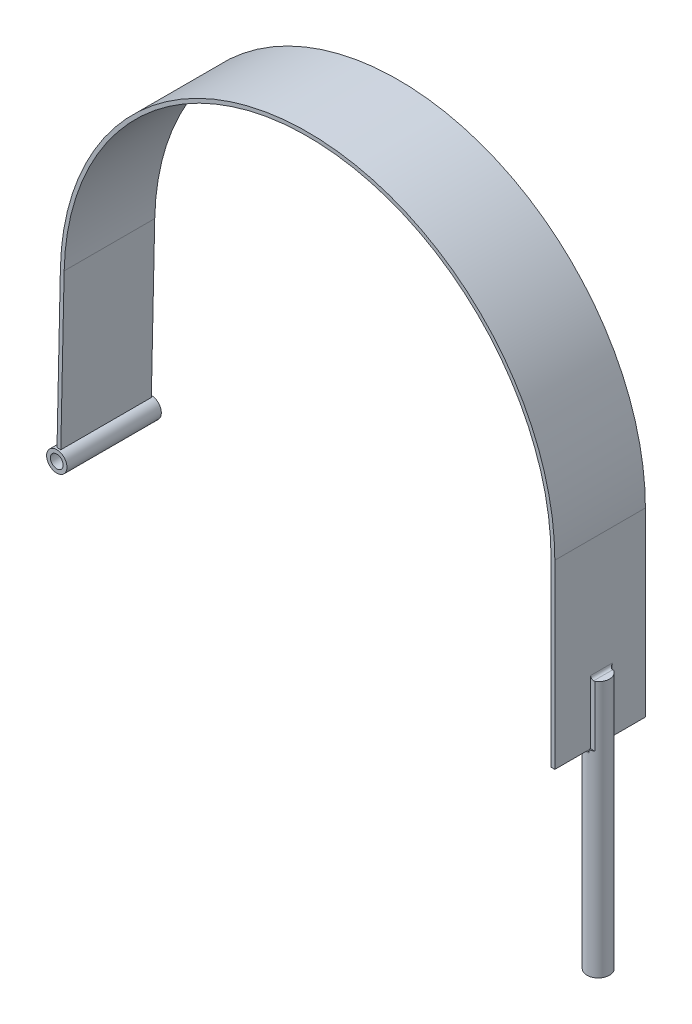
ISO-10303-21;
HEADER;
FILE_DESCRIPTION(('STEP AP214'),'2;1');
FILE_NAME('part.step','',(''),(''),'','','');
FILE_SCHEMA(('AUTOMOTIVE_DESIGN { 1 0 10303 214 1 1 1 1 }'));
ENDSEC;
DATA;
#1=APPLICATION_CONTEXT('core data for automotive mechanical design processes');
#2=APPLICATION_PROTOCOL_DEFINITION('international standard','automotive_design',2000,#1);
#3=PRODUCT_CONTEXT('',#1,'mechanical');
#4=PRODUCT('Part','Part','',(#3));
#5=PRODUCT_RELATED_PRODUCT_CATEGORY('part','',(#4));
#6=PRODUCT_DEFINITION_FORMATION('','',#4);
#7=PRODUCT_DEFINITION_CONTEXT('part definition',#1,'design');
#8=PRODUCT_DEFINITION('design','',#6,#7);
#9=PRODUCT_DEFINITION_SHAPE('','',#8);
#10=(LENGTH_UNIT() NAMED_UNIT(*) SI_UNIT(.MILLI.,.METRE.));
#11=(NAMED_UNIT(*) PLANE_ANGLE_UNIT() SI_UNIT($,.RADIAN.));
#12=(NAMED_UNIT(*) SI_UNIT($,.STERADIAN.) SOLID_ANGLE_UNIT());
#13=UNCERTAINTY_MEASURE_WITH_UNIT(LENGTH_MEASURE(1.E-05),#10,'distance_accuracy_value','');
#14=(GEOMETRIC_REPRESENTATION_CONTEXT(3) GLOBAL_UNCERTAINTY_ASSIGNED_CONTEXT((#13)) GLOBAL_UNIT_ASSIGNED_CONTEXT((#10,
#11,#12)) REPRESENTATION_CONTEXT('',''));
#15=CARTESIAN_POINT('',(0.,0.,0.));
#16=DIRECTION('',(0.,0.,1.));
#17=DIRECTION('',(1.,0.,0.));
#18=AXIS2_PLACEMENT_3D('',#15,#16,#17);
#19=CARTESIAN_POINT('',(-209.417704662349,-135.914745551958,39.6875));
#20=DIRECTION('',(0.,0.,1.));
#21=DIRECTION('',(1.,0.,0.));
#22=AXIS2_PLACEMENT_3D('',#19,#20,#21);
#23=PLANE('',#22);
#24=CARTESIAN_POINT('',(-209.417704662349,-135.914745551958,39.6875));
#25=DIRECTION('',(0.,0.,1.));
#26=DIRECTION('',(1.,0.,0.));
#27=AXIS2_PLACEMENT_3D('',#24,#25,#26);
#28=CIRCLE('',#27,8.57250000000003);
#29=CARTESIAN_POINT('',(-217.990204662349,-135.914745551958,39.6875));
#30=VERTEX_POINT('',#29);
#31=EDGE_CURVE('E11',#30,#30,#28,.T.);
#32=ORIENTED_EDGE('',*,*,#31,.T.);
#33=EDGE_LOOP('',(#32));
#34=FACE_BOUND('',#33,.T.);
#35=CARTESIAN_POINT('',(-209.417704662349,-135.914745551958,39.6875));
#36=DIRECTION('',(0.,0.,1.));
#37=DIRECTION('',(1.,0.,0.));
#38=AXIS2_PLACEMENT_3D('',#35,#36,#37);
#39=CIRCLE('',#38,5.37209999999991);
#40=CARTESIAN_POINT('',(-214.789804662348,-135.914745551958,39.6875));
#41=VERTEX_POINT('',#40);
#42=EDGE_CURVE('E45',#41,#41,#39,.T.);
#43=ORIENTED_EDGE('',*,*,#42,.F.);
#44=EDGE_LOOP('',(#43));
#45=FACE_BOUND('',#44,.T.);
#46=ADVANCED_FACE('F34',(#34,#45),#23,.T.);
#47=CARTESIAN_POINT('',(-209.417704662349,-135.914745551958,-39.6875));
#48=DIRECTION('',(0.,0.,1.));
#49=DIRECTION('',(1.,0.,0.));
#50=AXIS2_PLACEMENT_3D('',#47,#48,#49);
#51=PLANE('',#50);
#52=CARTESIAN_POINT('',(-209.417704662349,-135.914745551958,-39.6875));
#53=DIRECTION('',(0.,0.,1.));
#54=DIRECTION('',(1.,0.,0.));
#55=AXIS2_PLACEMENT_3D('',#52,#53,#54);
#56=CIRCLE('',#55,8.57250000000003);
#57=CARTESIAN_POINT('',(-217.990204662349,-135.914745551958,-39.6875));
#58=VERTEX_POINT('',#57);
#59=EDGE_CURVE('E41',#58,#58,#56,.T.);
#60=ORIENTED_EDGE('',*,*,#59,.F.);
#61=EDGE_LOOP('',(#60));
#62=FACE_BOUND('',#61,.T.);
#63=CARTESIAN_POINT('',(-209.417704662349,-135.914745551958,-39.6875));
#64=DIRECTION('',(0.,0.,1.));
#65=DIRECTION('',(1.,0.,0.));
#66=AXIS2_PLACEMENT_3D('',#63,#64,#65);
#67=CIRCLE('',#66,5.37209999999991);
#68=CARTESIAN_POINT('',(-214.789804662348,-135.914745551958,-39.6875));
#69=VERTEX_POINT('',#68);
#70=EDGE_CURVE('E49',#69,#69,#67,.T.);
#71=ORIENTED_EDGE('',*,*,#70,.T.);
#72=EDGE_LOOP('',(#71));
#73=FACE_BOUND('',#72,.T.);
#74=ADVANCED_FACE('F55',(#62,#73),#51,.F.);
#75=CARTESIAN_POINT('',(-209.417704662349,-135.914745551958,39.6875));
#76=DIRECTION('',(0.,0.,-1.));
#77=DIRECTION('',(-1.,0.,0.));
#78=AXIS2_PLACEMENT_3D('',#75,#76,#77);
#79=CYLINDRICAL_SURFACE('',#78,8.57250000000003);
#80=CARTESIAN_POINT('',(-217.990204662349,-135.914745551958,39.6875));
#81=CARTESIAN_POINT('',(-217.990204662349,-135.914745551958,38.8606770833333));
#82=CARTESIAN_POINT('',(-217.990204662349,-135.914745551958,38.0338541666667));
#83=CARTESIAN_POINT('',(-217.990204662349,-135.914745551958,36.3802083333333));
#84=CARTESIAN_POINT('',(-217.990204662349,-135.914745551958,35.5533854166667));
#85=CARTESIAN_POINT('',(-217.990204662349,-135.914745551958,33.8997395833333));
#86=CARTESIAN_POINT('',(-217.990204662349,-135.914745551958,33.0729166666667));
#87=CARTESIAN_POINT('',(-217.990204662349,-135.914745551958,31.4192708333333));
#88=CARTESIAN_POINT('',(-217.990204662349,-135.914745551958,30.5924479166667));
#89=CARTESIAN_POINT('',(-217.990204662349,-135.914745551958,28.9388020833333));
#90=CARTESIAN_POINT('',(-217.990204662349,-135.914745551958,28.1119791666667));
#91=CARTESIAN_POINT('',(-217.990204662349,-135.914745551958,26.4583333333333));
#92=CARTESIAN_POINT('',(-217.990204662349,-135.914745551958,25.6315104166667));
#93=CARTESIAN_POINT('',(-217.990204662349,-135.914745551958,23.9778645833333));
#94=CARTESIAN_POINT('',(-217.990204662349,-135.914745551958,23.1510416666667));
#95=CARTESIAN_POINT('',(-217.990204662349,-135.914745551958,21.4973958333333));
#96=CARTESIAN_POINT('',(-217.990204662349,-135.914745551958,20.6705729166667));
#97=CARTESIAN_POINT('',(-217.990204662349,-135.914745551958,19.0169270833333));
#98=CARTESIAN_POINT('',(-217.990204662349,-135.914745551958,18.1901041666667));
#99=CARTESIAN_POINT('',(-217.990204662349,-135.914745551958,16.5364583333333));
#100=CARTESIAN_POINT('',(-217.990204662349,-135.914745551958,15.7096354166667));
#101=CARTESIAN_POINT('',(-217.990204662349,-135.914745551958,14.0559895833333));
#102=CARTESIAN_POINT('',(-217.990204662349,-135.914745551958,13.2291666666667));
#103=CARTESIAN_POINT('',(-217.990204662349,-135.914745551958,11.5755208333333));
#104=CARTESIAN_POINT('',(-217.990204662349,-135.914745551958,10.7486979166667));
#105=CARTESIAN_POINT('',(-217.990204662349,-135.914745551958,9.09505208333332));
#106=CARTESIAN_POINT('',(-217.990204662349,-135.914745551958,8.26822916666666));
#107=CARTESIAN_POINT('',(-217.990204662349,-135.914745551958,6.61458333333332));
#108=CARTESIAN_POINT('',(-217.990204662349,-135.914745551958,5.78776041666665));
#109=CARTESIAN_POINT('',(-217.990204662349,-135.914745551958,4.13411458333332));
#110=CARTESIAN_POINT('',(-217.990204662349,-135.914745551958,3.30729166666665));
#111=CARTESIAN_POINT('',(-217.990204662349,-135.914745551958,1.65364583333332));
#112=CARTESIAN_POINT('',(-217.990204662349,-135.914745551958,0.826822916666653));
#113=CARTESIAN_POINT('',(-217.990204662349,-135.914745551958,-0.82682291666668));
#114=CARTESIAN_POINT('',(-217.990204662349,-135.914745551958,-1.65364583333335));
#115=CARTESIAN_POINT('',(-217.990204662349,-135.914745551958,-3.30729166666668));
#116=CARTESIAN_POINT('',(-217.990204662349,-135.914745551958,-4.13411458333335));
#117=CARTESIAN_POINT('',(-217.990204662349,-135.914745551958,-5.78776041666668));
#118=CARTESIAN_POINT('',(-217.990204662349,-135.914745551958,-6.61458333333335));
#119=CARTESIAN_POINT('',(-217.990204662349,-135.914745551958,-8.26822916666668));
#120=CARTESIAN_POINT('',(-217.990204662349,-135.914745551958,-9.09505208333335));
#121=CARTESIAN_POINT('',(-217.990204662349,-135.914745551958,-10.7486979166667));
#122=CARTESIAN_POINT('',(-217.990204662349,-135.914745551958,-11.5755208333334));
#123=CARTESIAN_POINT('',(-217.990204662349,-135.914745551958,-13.2291666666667));
#124=CARTESIAN_POINT('',(-217.990204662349,-135.914745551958,-14.0559895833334));
#125=CARTESIAN_POINT('',(-217.990204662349,-135.914745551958,-15.7096354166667));
#126=CARTESIAN_POINT('',(-217.990204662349,-135.914745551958,-16.5364583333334));
#127=CARTESIAN_POINT('',(-217.990204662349,-135.914745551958,-18.1901041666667));
#128=CARTESIAN_POINT('',(-217.990204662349,-135.914745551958,-19.0169270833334));
#129=CARTESIAN_POINT('',(-217.990204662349,-135.914745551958,-20.6705729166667));
#130=CARTESIAN_POINT('',(-217.990204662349,-135.914745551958,-21.4973958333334));
#131=CARTESIAN_POINT('',(-217.990204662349,-135.914745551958,-23.1510416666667));
#132=CARTESIAN_POINT('',(-217.990204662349,-135.914745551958,-23.9778645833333));
#133=CARTESIAN_POINT('',(-217.990204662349,-135.914745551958,-25.6315104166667));
#134=CARTESIAN_POINT('',(-217.990204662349,-135.914745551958,-26.4583333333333));
#135=CARTESIAN_POINT('',(-217.990204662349,-135.914745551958,-28.1119791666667));
#136=CARTESIAN_POINT('',(-217.990204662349,-135.914745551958,-28.9388020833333));
#137=CARTESIAN_POINT('',(-217.990204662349,-135.914745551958,-30.5924479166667));
#138=CARTESIAN_POINT('',(-217.990204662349,-135.914745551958,-31.4192708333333));
#139=CARTESIAN_POINT('',(-217.990204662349,-135.914745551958,-33.0729166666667));
#140=CARTESIAN_POINT('',(-217.990204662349,-135.914745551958,-33.8997395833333));
#141=CARTESIAN_POINT('',(-217.990204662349,-135.914745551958,-35.5533854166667));
#142=CARTESIAN_POINT('',(-217.990204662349,-135.914745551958,-36.3802083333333));
#143=CARTESIAN_POINT('',(-217.990204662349,-135.914745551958,-38.0338541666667));
#144=CARTESIAN_POINT('',(-217.990204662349,-135.914745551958,-38.8606770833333));
#145=CARTESIAN_POINT('',(-217.990204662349,-135.914745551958,-39.6875));
#146=B_SPLINE_CURVE_WITH_KNOTS('',3,(#80,#81,#82,#83,#84,#85,#86,#87,#88,#89,#90,#91,#92,#93,
#94,#95,#96,#97,#98,#99,#100,#101,#102,#103,#104,#105,#106,#107,#108,#109,#110,#111,#112,#113,
#114,#115,#116,#117,#118,#119,#120,#121,#122,#123,#124,#125,#126,#127,#128,#129,#130,#131,#132,
#133,#134,#135,#136,#137,#138,#139,#140,#141,#142,#143,#144,#145),.UNSPECIFIED.,.F.,.F.,(4,2,2,
2,2,2,2,2,2,2,2,2,2,2,2,2,2,2,2,2,2,2,2,2,2,2,2,2,2,2,2,2,4),(0.,2.48046875,4.9609375,
7.44140625,9.921875,12.40234375,14.8828125,17.36328125,19.84375,22.32421875,24.8046875,
27.28515625,29.765625,32.24609375,34.7265625,37.20703125,39.6875,42.16796875,44.6484375,
47.12890625,49.609375,52.08984375,54.5703125,57.05078125,59.53125,62.01171875,64.4921875,
66.97265625,69.453125,71.93359375,74.4140625,76.89453125,79.375),.UNSPECIFIED.);
#147=EDGE_CURVE('BSEAM36',#30,#58,#146,.T.);
#148=ORIENTED_EDGE('',*,*,#31,.F.);
#149=ORIENTED_EDGE('',*,*,#59,.T.);
#150=ORIENTED_EDGE('',*,*,#147,.T.);
#151=ORIENTED_EDGE('',*,*,#147,.F.);
#152=EDGE_LOOP('',(#148,#150,#149,#151));
#153=FACE_BOUND('',#152,.T.);
#154=ADVANCED_FACE('F36',(#153),#79,.T.);
#155=CARTESIAN_POINT('',(-209.417704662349,-135.914745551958,39.6875));
#156=DIRECTION('',(0.,0.,-1.));
#157=DIRECTION('',(-1.,0.,0.));
#158=AXIS2_PLACEMENT_3D('',#155,#156,#157);
#159=CYLINDRICAL_SURFACE('',#158,5.37209999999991);
#160=CARTESIAN_POINT('',(-214.789804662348,-135.914745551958,39.6875));
#161=CARTESIAN_POINT('',(-214.789804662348,-135.914745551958,38.8606770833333));
#162=CARTESIAN_POINT('',(-214.789804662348,-135.914745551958,38.0338541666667));
#163=CARTESIAN_POINT('',(-214.789804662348,-135.914745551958,36.3802083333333));
#164=CARTESIAN_POINT('',(-214.789804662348,-135.914745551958,35.5533854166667));
#165=CARTESIAN_POINT('',(-214.789804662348,-135.914745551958,33.8997395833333));
#166=CARTESIAN_POINT('',(-214.789804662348,-135.914745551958,33.0729166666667));
#167=CARTESIAN_POINT('',(-214.789804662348,-135.914745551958,31.4192708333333));
#168=CARTESIAN_POINT('',(-214.789804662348,-135.914745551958,30.5924479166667));
#169=CARTESIAN_POINT('',(-214.789804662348,-135.914745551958,28.9388020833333));
#170=CARTESIAN_POINT('',(-214.789804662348,-135.914745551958,28.1119791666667));
#171=CARTESIAN_POINT('',(-214.789804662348,-135.914745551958,26.4583333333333));
#172=CARTESIAN_POINT('',(-214.789804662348,-135.914745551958,25.6315104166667));
#173=CARTESIAN_POINT('',(-214.789804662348,-135.914745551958,23.9778645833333));
#174=CARTESIAN_POINT('',(-214.789804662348,-135.914745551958,23.1510416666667));
#175=CARTESIAN_POINT('',(-214.789804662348,-135.914745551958,21.4973958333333));
#176=CARTESIAN_POINT('',(-214.789804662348,-135.914745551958,20.6705729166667));
#177=CARTESIAN_POINT('',(-214.789804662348,-135.914745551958,19.0169270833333));
#178=CARTESIAN_POINT('',(-214.789804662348,-135.914745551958,18.1901041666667));
#179=CARTESIAN_POINT('',(-214.789804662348,-135.914745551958,16.5364583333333));
#180=CARTESIAN_POINT('',(-214.789804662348,-135.914745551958,15.7096354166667));
#181=CARTESIAN_POINT('',(-214.789804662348,-135.914745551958,14.0559895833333));
#182=CARTESIAN_POINT('',(-214.789804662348,-135.914745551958,13.2291666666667));
#183=CARTESIAN_POINT('',(-214.789804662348,-135.914745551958,11.5755208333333));
#184=CARTESIAN_POINT('',(-214.789804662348,-135.914745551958,10.7486979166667));
#185=CARTESIAN_POINT('',(-214.789804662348,-135.914745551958,9.09505208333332));
#186=CARTESIAN_POINT('',(-214.789804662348,-135.914745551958,8.26822916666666));
#187=CARTESIAN_POINT('',(-214.789804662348,-135.914745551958,6.61458333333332));
#188=CARTESIAN_POINT('',(-214.789804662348,-135.914745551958,5.78776041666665));
#189=CARTESIAN_POINT('',(-214.789804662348,-135.914745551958,4.13411458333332));
#190=CARTESIAN_POINT('',(-214.789804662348,-135.914745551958,3.30729166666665));
#191=CARTESIAN_POINT('',(-214.789804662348,-135.914745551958,1.65364583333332));
#192=CARTESIAN_POINT('',(-214.789804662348,-135.914745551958,0.826822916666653));
#193=CARTESIAN_POINT('',(-214.789804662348,-135.914745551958,-0.82682291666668));
#194=CARTESIAN_POINT('',(-214.789804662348,-135.914745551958,-1.65364583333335));
#195=CARTESIAN_POINT('',(-214.789804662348,-135.914745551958,-3.30729166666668));
#196=CARTESIAN_POINT('',(-214.789804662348,-135.914745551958,-4.13411458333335));
#197=CARTESIAN_POINT('',(-214.789804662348,-135.914745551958,-5.78776041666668));
#198=CARTESIAN_POINT('',(-214.789804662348,-135.914745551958,-6.61458333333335));
#199=CARTESIAN_POINT('',(-214.789804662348,-135.914745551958,-8.26822916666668));
#200=CARTESIAN_POINT('',(-214.789804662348,-135.914745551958,-9.09505208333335));
#201=CARTESIAN_POINT('',(-214.789804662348,-135.914745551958,-10.7486979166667));
#202=CARTESIAN_POINT('',(-214.789804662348,-135.914745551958,-11.5755208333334));
#203=CARTESIAN_POINT('',(-214.789804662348,-135.914745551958,-13.2291666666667));
#204=CARTESIAN_POINT('',(-214.789804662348,-135.914745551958,-14.0559895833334));
#205=CARTESIAN_POINT('',(-214.789804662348,-135.914745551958,-15.7096354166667));
#206=CARTESIAN_POINT('',(-214.789804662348,-135.914745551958,-16.5364583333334));
#207=CARTESIAN_POINT('',(-214.789804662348,-135.914745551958,-18.1901041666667));
#208=CARTESIAN_POINT('',(-214.789804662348,-135.914745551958,-19.0169270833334));
#209=CARTESIAN_POINT('',(-214.789804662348,-135.914745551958,-20.6705729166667));
#210=CARTESIAN_POINT('',(-214.789804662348,-135.914745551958,-21.4973958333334));
#211=CARTESIAN_POINT('',(-214.789804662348,-135.914745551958,-23.1510416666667));
#212=CARTESIAN_POINT('',(-214.789804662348,-135.914745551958,-23.9778645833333));
#213=CARTESIAN_POINT('',(-214.789804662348,-135.914745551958,-25.6315104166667));
#214=CARTESIAN_POINT('',(-214.789804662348,-135.914745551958,-26.4583333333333));
#215=CARTESIAN_POINT('',(-214.789804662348,-135.914745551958,-28.1119791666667));
#216=CARTESIAN_POINT('',(-214.789804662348,-135.914745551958,-28.9388020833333));
#217=CARTESIAN_POINT('',(-214.789804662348,-135.914745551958,-30.5924479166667));
#218=CARTESIAN_POINT('',(-214.789804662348,-135.914745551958,-31.4192708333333));
#219=CARTESIAN_POINT('',(-214.789804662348,-135.914745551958,-33.0729166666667));
#220=CARTESIAN_POINT('',(-214.789804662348,-135.914745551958,-33.8997395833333));
#221=CARTESIAN_POINT('',(-214.789804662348,-135.914745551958,-35.5533854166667));
#222=CARTESIAN_POINT('',(-214.789804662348,-135.914745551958,-36.3802083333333));
#223=CARTESIAN_POINT('',(-214.789804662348,-135.914745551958,-38.0338541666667));
#224=CARTESIAN_POINT('',(-214.789804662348,-135.914745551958,-38.8606770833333));
#225=CARTESIAN_POINT('',(-214.789804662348,-135.914745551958,-39.6875));
#226=B_SPLINE_CURVE_WITH_KNOTS('',3,(#160,#161,#162,#163,#164,#165,#166,#167,#168,#169,#170,
#171,#172,#173,#174,#175,#176,#177,#178,#179,#180,#181,#182,#183,#184,#185,#186,#187,#188,#189,
#190,#191,#192,#193,#194,#195,#196,#197,#198,#199,#200,#201,#202,#203,#204,#205,#206,#207,#208,
#209,#210,#211,#212,#213,#214,#215,#216,#217,#218,#219,#220,#221,#222,#223,#224,#225),
.UNSPECIFIED.,.F.,.F.,(4,2,2,2,2,2,2,2,2,2,2,2,2,2,2,2,2,2,2,2,2,2,2,2,2,2,2,2,2,2,2,2,4),(0.,
2.48046875,4.9609375,7.44140625,9.921875,12.40234375,14.8828125,17.36328125,19.84375,
22.32421875,24.8046875,27.28515625,29.765625,32.24609375,34.7265625,37.20703125,39.6875,
42.16796875,44.6484375,47.12890625,49.609375,52.08984375,54.5703125,57.05078125,59.53125,
62.01171875,64.4921875,66.97265625,69.453125,71.93359375,74.4140625,76.89453125,79.375),.UNSPECIFIED.);
#227=EDGE_CURVE('BSEAM57',#41,#69,#226,.T.);
#228=ORIENTED_EDGE('',*,*,#42,.T.);
#229=ORIENTED_EDGE('',*,*,#70,.F.);
#230=ORIENTED_EDGE('',*,*,#227,.T.);
#231=ORIENTED_EDGE('',*,*,#227,.F.);
#232=EDGE_LOOP('',(#228,#230,#229,#231));
#233=FACE_BOUND('',#232,.T.);
#234=ADVANCED_FACE('F57',(#233),#159,.F.);
#235=CLOSED_SHELL('',(#46,#74,#154,#234));
#236=MANIFOLD_SOLID_BREP('B2',#235);
#237=CARTESIAN_POINT('',(206.4258,-152.4,0.));
#238=DIRECTION('',(0.,-1.,0.));
#239=DIRECTION('',(0.,0.,-1.));
#240=AXIS2_PLACEMENT_3D('',#237,#238,#239);
#241=PLANE('',#240);
#242=CARTESIAN_POINT('',(206.4258,-152.4,0.));
#243=DIRECTION('',(0.,-1.,0.));
#244=DIRECTION('',(0.,0.,-1.));
#245=AXIS2_PLACEMENT_3D('',#242,#243,#244);
#246=CIRCLE('',#245,9.525);
#247=CARTESIAN_POINT('',(204.548095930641,-152.4,9.33808612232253));
#248=VERTEX_POINT('',#247);
#249=CARTESIAN_POINT('',(201.257664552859,-152.4,8.00099999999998));
#250=VERTEX_POINT('',#249);
#251=EDGE_CURVE('E262',#248,#250,#246,.T.);
#252=ORIENTED_EDGE('',*,*,#251,.F.);
#253=CARTESIAN_POINT('',(202.311,-152.4,10.541));
#254=DIRECTION('',(0.,-1.,0.));
#255=DIRECTION('',(0.,0.,-1.));
#256=AXIS2_PLACEMENT_3D('',#253,#254,#255);
#257=CIRCLE('',#256,2.54);
#258=CARTESIAN_POINT('',(202.311,-152.4,8.00099999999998));
#259=VERTEX_POINT('',#258);
#260=EDGE_CURVE('E288',#248,#259,#257,.F.);
#261=ORIENTED_EDGE('',*,*,#260,.T.);
#262=DIRECTION('',(1.,0.,0.));
#263=VECTOR('',#262,1.);
#264=CARTESIAN_POINT('',(211.593935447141,-152.4,8.00099999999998));
#265=LINE('',#264,#263);
#266=EDGE_CURVE('E281',#250,#259,#265,.T.);
#267=ORIENTED_EDGE('',*,*,#266,.F.);
#268=EDGE_LOOP('',(#252,#261,#267));
#269=FACE_BOUND('',#268,.T.);
#270=ADVANCED_FACE('F87',(#269),#241,.F.);
#271=CARTESIAN_POINT('',(208.026,-152.4,8.00099999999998));
#272=VERTEX_POINT('',#271);
#273=CARTESIAN_POINT('',(211.593935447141,-152.4,8.00099999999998));
#274=VERTEX_POINT('',#273);
#275=EDGE_CURVE('E290',#272,#274,#265,.T.);
#276=ORIENTED_EDGE('',*,*,#275,.F.);
#277=DIRECTION('',(0.,0.,-1.));
#278=VECTOR('',#277,1.);
#279=CARTESIAN_POINT('',(208.026,-152.4,38.1));
#280=LINE('',#279,#278);
#281=CARTESIAN_POINT('',(208.026,-152.4,9.3896211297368));
#282=VERTEX_POINT('',#281);
#283=EDGE_CURVE('E320',#282,#272,#280,.T.);
#284=ORIENTED_EDGE('',*,*,#283,.F.);
#285=EDGE_CURVE('E274',#274,#282,#246,.T.);
#286=ORIENTED_EDGE('',*,*,#285,.F.);
#287=EDGE_LOOP('',(#276,#284,#286));
#288=FACE_BOUND('',#287,.T.);
#289=ADVANCED_FACE('F551',(#288),#241,.F.);
#290=CARTESIAN_POINT('',(208.332021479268,-152.4,-9.33230650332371));
#291=VERTEX_POINT('',#290);
#292=CARTESIAN_POINT('',(211.593935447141,-152.4,-8.00100000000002));
#293=VERTEX_POINT('',#292);
#294=EDGE_CURVE('E277',#291,#293,#246,.T.);
#295=ORIENTED_EDGE('',*,*,#294,.F.);
#296=CARTESIAN_POINT('',(210.566,-152.4,-10.541));
#297=DIRECTION('',(0.,-1.,0.));
#298=DIRECTION('',(0.,0.,-1.));
#299=AXIS2_PLACEMENT_3D('',#296,#297,#298);
#300=CIRCLE('',#299,2.54);
#301=CARTESIAN_POINT('',(210.566,-152.4,-8.00100000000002));
#302=VERTEX_POINT('',#301);
#303=EDGE_CURVE('E412',#291,#302,#300,.F.);
#304=ORIENTED_EDGE('',*,*,#303,.T.);
#305=DIRECTION('',(-1.,0.,0.));
#306=VECTOR('',#305,1.);
#307=CARTESIAN_POINT('',(201.257664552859,-152.4,-8.00100000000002));
#308=LINE('',#307,#306);
#309=EDGE_CURVE('E292',#293,#302,#308,.T.);
#310=ORIENTED_EDGE('',*,*,#309,.F.);
#311=EDGE_LOOP('',(#295,#304,#310));
#312=FACE_BOUND('',#311,.T.);
#313=ADVANCED_FACE('F605',(#312),#241,.F.);
#314=CARTESIAN_POINT('',(202.311,-152.4,-8.00100000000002));
#315=VERTEX_POINT('',#314);
#316=CARTESIAN_POINT('',(201.257664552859,-152.4,-8.00100000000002));
#317=VERTEX_POINT('',#316);
#318=EDGE_CURVE('E289',#315,#317,#308,.T.);
#319=ORIENTED_EDGE('',*,*,#318,.F.);
#320=CARTESIAN_POINT('',(202.311,-152.4,-10.541));
#321=DIRECTION('',(0.,-1.,0.));
#322=DIRECTION('',(0.,0.,-1.));
#323=AXIS2_PLACEMENT_3D('',#320,#321,#322);
#324=CIRCLE('',#323,2.54);
#325=CARTESIAN_POINT('',(204.548095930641,-152.4,-9.33808612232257));
#326=VERTEX_POINT('',#325);
#327=EDGE_CURVE('E397',#315,#326,#324,.F.);
#328=ORIENTED_EDGE('',*,*,#327,.T.);
#329=EDGE_CURVE('E275',#317,#326,#246,.T.);
#330=ORIENTED_EDGE('',*,*,#329,.F.);
#331=EDGE_LOOP('',(#319,#328,#330));
#332=FACE_BOUND('',#331,.T.);
#333=ADVANCED_FACE('F583',(#332),#241,.F.);
#334=CARTESIAN_POINT('',(208.026,-152.4,38.1));
#335=DIRECTION('',(0.,-1.,0.));
#336=DIRECTION('',(0.,0.,-1.));
#337=AXIS2_PLACEMENT_3D('',#334,#335,#336);
#338=PLANE('',#337);
#339=DIRECTION('',(0.,0.,-1.));
#340=VECTOR('',#339,1.);
#341=CARTESIAN_POINT('',(204.851,-152.4,38.1));
#342=LINE('',#341,#340);
#343=CARTESIAN_POINT('',(204.851,-152.4,38.1));
#344=VERTEX_POINT('',#343);
#345=CARTESIAN_POINT('',(204.851,-152.4,11.9617820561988));
#346=VERTEX_POINT('',#345);
#347=EDGE_CURVE('E387',#344,#346,#342,.T.);
#348=ORIENTED_EDGE('',*,*,#347,.T.);
#349=CARTESIAN_POINT('',(206.4258,-152.4,0.));
#350=DIRECTION('',(0.,-1.,0.));
#351=DIRECTION('',(0.,0.,-1.));
#352=AXIS2_PLACEMENT_3D('',#349,#350,#351);
#353=CIRCLE('',#352,12.065);
#354=CARTESIAN_POINT('',(208.026,-152.4,11.9584106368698));
#355=VERTEX_POINT('',#354);
#356=EDGE_CURVE('E425',#346,#355,#353,.F.);
#357=ORIENTED_EDGE('',*,*,#356,.T.);
#358=DIRECTION('',(0.,0.,-1.));
#359=VECTOR('',#358,1.);
#360=CARTESIAN_POINT('',(208.026,-152.4,38.1));
#361=LINE('',#360,#359);
#362=CARTESIAN_POINT('',(208.026,-152.4,38.1));
#363=VERTEX_POINT('',#362);
#364=EDGE_CURVE('E383',#363,#355,#361,.T.);
#365=ORIENTED_EDGE('',*,*,#364,.F.);
#366=DIRECTION('',(-1.,0.,0.));
#367=VECTOR('',#366,1.);
#368=CARTESIAN_POINT('',(208.026,-152.4,38.1));
#369=LINE('',#368,#367);
#370=EDGE_CURVE('E349',#363,#344,#369,.T.);
#371=ORIENTED_EDGE('',*,*,#370,.T.);
#372=EDGE_LOOP('',(#348,#357,#365,#371));
#373=FACE_BOUND('',#372,.T.);
#374=ADVANCED_FACE('F470',(#373),#338,.T.);
#375=CARTESIAN_POINT('',(208.026,-152.4,-11.9584106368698));
#376=VERTEX_POINT('',#375);
#377=CARTESIAN_POINT('',(208.026,-152.4,-38.1));
#378=VERTEX_POINT('',#377);
#379=EDGE_CURVE('E382',#376,#378,#361,.T.);
#380=ORIENTED_EDGE('',*,*,#379,.F.);
#381=CARTESIAN_POINT('',(206.4258,-152.4,0.));
#382=DIRECTION('',(0.,-1.,0.));
#383=DIRECTION('',(0.,0.,-1.));
#384=AXIS2_PLACEMENT_3D('',#381,#382,#383);
#385=CIRCLE('',#384,12.065);
#386=CARTESIAN_POINT('',(204.851,-152.4,-11.9617820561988));
#387=VERTEX_POINT('',#386);
#388=EDGE_CURVE('E497',#376,#387,#385,.F.);
#389=ORIENTED_EDGE('',*,*,#388,.T.);
#390=CARTESIAN_POINT('',(204.851,-152.4,-38.1));
#391=VERTEX_POINT('',#390);
#392=EDGE_CURVE('E386',#387,#391,#342,.T.);
#393=ORIENTED_EDGE('',*,*,#392,.T.);
#394=DIRECTION('',(-1.,0.,0.));
#395=VECTOR('',#394,1.);
#396=CARTESIAN_POINT('',(208.026,-152.4,-38.1));
#397=LINE('',#396,#395);
#398=EDGE_CURVE('E328',#378,#391,#397,.T.);
#399=ORIENTED_EDGE('',*,*,#398,.F.);
#400=EDGE_LOOP('',(#380,#389,#393,#399));
#401=FACE_BOUND('',#400,.T.);
#402=ADVANCED_FACE('F510',(#401),#338,.T.);
#403=CARTESIAN_POINT('',(204.851,0.,38.1));
#404=DIRECTION('',(1.,0.,0.));
#405=DIRECTION('',(0.,0.,-1.));
#406=AXIS2_PLACEMENT_3D('',#403,#404,#405);
#407=PLANE('',#406);
#408=ORIENTED_EDGE('',*,*,#392,.F.);
#409=CARTESIAN_POINT('',(204.851,-152.4,-11.9617820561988));
#410=CARTESIAN_POINT('',(204.851,-152.399992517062,-11.8882198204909));
#411=CARTESIAN_POINT('',(204.851,-152.403141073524,-11.8146591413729));
#412=CARTESIAN_POINT('',(204.851,-152.415690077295,-11.6680626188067));
#413=CARTESIAN_POINT('',(204.851,-152.425091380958,-11.5950268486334));
#414=CARTESIAN_POINT('',(204.851,-152.449787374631,-11.4517528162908));
#415=CARTESIAN_POINT('',(204.851,-152.464936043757,-11.3814893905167));
#416=CARTESIAN_POINT('',(204.851,-152.501015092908,-11.2424898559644));
#417=CARTESIAN_POINT('',(204.851,-152.521943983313,-11.1737533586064));
#418=CARTESIAN_POINT('',(204.851,-152.580245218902,-11.0074965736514));
#419=CARTESIAN_POINT('',(204.851,-152.620770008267,-10.9110643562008));
#420=CARTESIAN_POINT('',(204.851,-152.713982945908,-10.7221313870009));
#421=CARTESIAN_POINT('',(204.851,-152.766874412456,-10.6297309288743));
#422=CARTESIAN_POINT('',(204.851,-152.825310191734,-10.541));
#423=B_SPLINE_CURVE_WITH_KNOTS('',3,(#409,#410,#411,#412,#413,#414,#415,#416,#417,#418,#419,
#420,#421,#422),.UNSPECIFIED.,.F.,.F.,(4,2,2,2,2,2,4),(0.,0.220617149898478,0.441264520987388,
0.656645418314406,0.871970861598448,1.18497856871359,1.50354760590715),.UNSPECIFIED.);
#424=CARTESIAN_POINT('',(204.851,-152.825310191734,-10.541));
#425=VERTEX_POINT('',#424);
#426=EDGE_CURVE('E101',#387,#425,#423,.T.);
#427=ORIENTED_EDGE('',*,*,#426,.T.);
#428=DIRECTION('',(0.,1.,0.));
#429=VECTOR('',#428,1.);
#430=CARTESIAN_POINT('',(204.851,-101.6,-10.541));
#431=LINE('',#430,#429);
#432=CARTESIAN_POINT('',(204.851,-99.06,-10.541));
#433=VERTEX_POINT('',#432);
#434=EDGE_CURVE('E113',#425,#433,#431,.T.);
#435=ORIENTED_EDGE('',*,*,#434,.T.);
#436=DIRECTION('',(0.,0.,1.));
#437=VECTOR('',#436,1.);
#438=CARTESIAN_POINT('',(204.851,-99.06,38.1));
#439=LINE('',#438,#437);
#440=CARTESIAN_POINT('',(204.851,-99.06,10.541));
#441=VERTEX_POINT('',#440);
#442=EDGE_CURVE('E392',#433,#441,#439,.T.);
#443=ORIENTED_EDGE('',*,*,#442,.T.);
#444=DIRECTION('',(0.,-1.,0.));
#445=VECTOR('',#444,1.);
#446=CARTESIAN_POINT('',(204.851,-152.4,10.541));
#447=LINE('',#446,#445);
#448=CARTESIAN_POINT('',(204.851,-152.825310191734,10.541));
#449=VERTEX_POINT('',#448);
#450=EDGE_CURVE('E390',#441,#449,#447,.T.);
#451=ORIENTED_EDGE('',*,*,#450,.T.);
#452=CARTESIAN_POINT('',(204.851,-152.825310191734,10.541));
#453=CARTESIAN_POINT('',(204.851,-152.784881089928,10.602424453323));
#454=CARTESIAN_POINT('',(204.851,-152.747095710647,10.665586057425));
#455=CARTESIAN_POINT('',(204.851,-152.677044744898,10.7949095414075));
#456=CARTESIAN_POINT('',(204.851,-152.644779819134,10.8610717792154));
#457=CARTESIAN_POINT('',(204.851,-152.586712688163,10.9942996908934));
#458=CARTESIAN_POINT('',(204.851,-152.560774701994,11.0613061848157));
#459=CARTESIAN_POINT('',(204.851,-152.514566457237,11.1972192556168));
#460=CARTESIAN_POINT('',(204.851,-152.494294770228,11.2661253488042));
#461=CARTESIAN_POINT('',(204.851,-152.451648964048,11.4370967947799));
#462=CARTESIAN_POINT('',(204.851,-152.432513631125,11.5399867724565));
#463=CARTESIAN_POINT('',(204.851,-152.406557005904,11.7491665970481));
#464=CARTESIAN_POINT('',(204.851,-152.399960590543,11.8554843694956));
#465=CARTESIAN_POINT('',(204.851,-152.4,11.9617820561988));
#466=B_SPLINE_CURVE_WITH_KNOTS('',3,(#452,#453,#454,#455,#456,#457,#458,#459,#460,#461,#462,
#463,#464,#465),.UNSPECIFIED.,.F.,.F.,(4,2,2,2,2,2,4),(0.,0.220535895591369,0.441098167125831,
0.656400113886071,0.871647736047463,1.18481520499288,1.5035479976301),.UNSPECIFIED.);
#467=EDGE_CURVE('E435',#449,#346,#466,.T.);
#468=ORIENTED_EDGE('',*,*,#467,.T.);
#469=ORIENTED_EDGE('',*,*,#347,.F.);
#470=DIRECTION('',(0.,1.,0.));
#471=VECTOR('',#470,1.);
#472=CARTESIAN_POINT('',(204.851,0.,38.1));
#473=LINE('',#472,#471);
#474=CARTESIAN_POINT('',(204.851,0.,38.1));
#475=VERTEX_POINT('',#474);
#476=EDGE_CURVE('E347',#475,#344,#473,.F.);
#477=ORIENTED_EDGE('',*,*,#476,.F.);
#478=DIRECTION('',(0.,0.,-1.));
#479=VECTOR('',#478,1.);
#480=CARTESIAN_POINT('',(204.851,0.,38.1));
#481=LINE('',#480,#479);
#482=CARTESIAN_POINT('',(204.851,0.,-38.1));
#483=VERTEX_POINT('',#482);
#484=EDGE_CURVE('E368',#475,#483,#481,.T.);
#485=ORIENTED_EDGE('',*,*,#484,.T.);
#486=DIRECTION('',(0.,1.,0.));
#487=VECTOR('',#486,1.);
#488=CARTESIAN_POINT('',(204.851,0.,-38.1));
#489=LINE('',#488,#487);
#490=EDGE_CURVE('E325',#483,#391,#489,.F.);
#491=ORIENTED_EDGE('',*,*,#490,.T.);
#492=EDGE_LOOP('',(#408,#427,#435,#443,#451,#468,#469,#477,#485,#491));
#493=FACE_BOUND('',#492,.T.);
#494=ADVANCED_FACE('F89',(#493),#407,.F.);
#495=CARTESIAN_POINT('',(208.026,0.,38.1));
#496=DIRECTION('',(1.,0.,0.));
#497=DIRECTION('',(0.,0.,-1.));
#498=AXIS2_PLACEMENT_3D('',#495,#496,#497);
#499=PLANE('',#498);
#500=DIRECTION('',(0.,0.,1.));
#501=VECTOR('',#500,1.);
#502=CARTESIAN_POINT('',(208.026,-99.06,-8.00100000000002));
#503=LINE('',#502,#501);
#504=CARTESIAN_POINT('',(208.026,-99.06,8.00099999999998));
#505=VERTEX_POINT('',#504);
#506=CARTESIAN_POINT('',(208.026,-99.06,-10.541));
#507=VERTEX_POINT('',#506);
#508=EDGE_CURVE('E408',#505,#507,#503,.F.);
#509=ORIENTED_EDGE('',*,*,#508,.T.);
#510=DIRECTION('',(0.,1.,0.));
#511=VECTOR('',#510,1.);
#512=CARTESIAN_POINT('',(208.026,0.,-10.541));
#513=LINE('',#512,#511);
#514=CARTESIAN_POINT('',(208.026,-152.822798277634,-10.541));
#515=VERTEX_POINT('',#514);
#516=EDGE_CURVE('E410',#507,#515,#513,.F.);
#517=ORIENTED_EDGE('',*,*,#516,.T.);
#518=CARTESIAN_POINT('',(208.026,-152.822798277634,-10.541));
#519=CARTESIAN_POINT('',(208.026,-152.782466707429,-10.6025362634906));
#520=CARTESIAN_POINT('',(208.026,-152.744783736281,-10.6658055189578));
#521=CARTESIAN_POINT('',(208.026,-152.674946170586,-10.7953354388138));
#522=CARTESIAN_POINT('',(208.026,-152.642792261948,-10.8615964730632));
#523=CARTESIAN_POINT('',(208.026,-152.584949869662,-10.9950150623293));
#524=CARTESIAN_POINT('',(208.026,-152.559125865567,-11.062113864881));
#525=CARTESIAN_POINT('',(208.026,-152.513153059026,-11.1982016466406));
#526=CARTESIAN_POINT('',(208.026,-152.493002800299,-11.2671901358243));
#527=CARTESIAN_POINT('',(208.026,-152.450860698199,-11.4375512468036));
#528=CARTESIAN_POINT('',(208.026,-152.432014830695,-11.5397179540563));
#529=CARTESIAN_POINT('',(208.026,-152.406455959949,-11.7473817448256));
#530=CARTESIAN_POINT('',(208.026,-152.399961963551,-11.8529058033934));
#531=CARTESIAN_POINT('',(208.026,-152.4,-11.9584106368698));
#532=B_SPLINE_CURVE_WITH_KNOTS('',3,(#518,#519,#520,#521,#522,#523,#524,#525,#526,#527,#528,
#529,#530,#531),.UNSPECIFIED.,.F.,.F.,(4,2,2,2,2,2,4),(0.,0.220655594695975,0.441338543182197,
0.65677564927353,0.872157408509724,1.18305182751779,1.49940901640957),.UNSPECIFIED.);
#533=EDGE_CURVE('E473',#515,#376,#532,.T.);
#534=ORIENTED_EDGE('',*,*,#533,.T.);
#535=ORIENTED_EDGE('',*,*,#379,.T.);
#536=DIRECTION('',(0.,-1.,0.));
#537=VECTOR('',#536,1.);
#538=CARTESIAN_POINT('',(208.026,0.,-38.1));
#539=LINE('',#538,#537);
#540=CARTESIAN_POINT('',(208.026,0.,-38.1));
#541=VERTEX_POINT('',#540);
#542=EDGE_CURVE('E331',#541,#378,#539,.T.);
#543=ORIENTED_EDGE('',*,*,#542,.F.);
#544=DIRECTION('',(0.,0.,-1.));
#545=VECTOR('',#544,1.);
#546=CARTESIAN_POINT('',(208.026,0.,38.1));
#547=LINE('',#546,#545);
#548=CARTESIAN_POINT('',(208.026,0.,38.1));
#549=VERTEX_POINT('',#548);
#550=EDGE_CURVE('E380',#549,#541,#547,.T.);
#551=ORIENTED_EDGE('',*,*,#550,.F.);
#552=DIRECTION('',(0.,-1.,0.));
#553=VECTOR('',#552,1.);
#554=CARTESIAN_POINT('',(208.026,0.,38.1));
#555=LINE('',#554,#553);
#556=EDGE_CURVE('E352',#549,#363,#555,.T.);
#557=ORIENTED_EDGE('',*,*,#556,.T.);
#558=ORIENTED_EDGE('',*,*,#364,.T.);
#559=CARTESIAN_POINT('',(208.026,-152.4,11.9584106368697));
#560=CARTESIAN_POINT('',(208.026,-152.399993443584,11.8856557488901));
#561=CARTESIAN_POINT('',(208.026,-152.403070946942,11.8129045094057));
#562=CARTESIAN_POINT('',(208.026,-152.415337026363,11.6679224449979));
#563=CARTESIAN_POINT('',(208.026,-152.42452530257,11.5956915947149));
#564=CARTESIAN_POINT('',(208.026,-152.448948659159,11.4522986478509));
#565=CARTESIAN_POINT('',(208.026,-152.46418015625,11.3811359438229));
#566=CARTESIAN_POINT('',(208.026,-152.50056674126,11.2403627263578));
#567=CARTESIAN_POINT('',(208.026,-152.521721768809,11.1707521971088));
#568=CARTESIAN_POINT('',(208.026,-152.593904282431,10.9649208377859));
#569=CARTESIAN_POINT('',(208.026,-152.653659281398,10.8316413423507));
#570=CARTESIAN_POINT('',(208.026,-152.79469977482,10.5771301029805));
#571=CARTESIAN_POINT('',(208.026,-152.87598101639,10.4558959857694));
#572=CARTESIAN_POINT('',(208.026,-153.057671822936,10.229118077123));
#573=CARTESIAN_POINT('',(208.026,-153.158040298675,10.123541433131));
#574=CARTESIAN_POINT('',(208.026,-153.375255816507,9.93091929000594));
#575=CARTESIAN_POINT('',(208.026,-153.492105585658,9.84387686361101));
#576=CARTESIAN_POINT('',(208.026,-153.737764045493,9.6917478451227));
#577=CARTESIAN_POINT('',(208.026,-153.866448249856,9.62646005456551));
#578=CARTESIAN_POINT('',(208.026,-154.133015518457,9.51877838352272));
#579=CARTESIAN_POINT('',(208.026,-154.270891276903,9.47636655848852));
#580=CARTESIAN_POINT('',(208.026,-154.498146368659,9.42730185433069));
#581=CARTESIAN_POINT('',(208.026,-154.585981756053,9.41318094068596));
#582=CARTESIAN_POINT('',(208.026,-154.762531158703,9.39434219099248));
#583=CARTESIAN_POINT('',(208.026,-154.851243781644,9.38961130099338));
#584=CARTESIAN_POINT('',(208.026,-154.94,9.38962112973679));
#585=B_SPLINE_CURVE_WITH_KNOTS('',3,(#559,#560,#561,#562,#563,#564,#565,#566,#567,#568,#569,
#570,#571,#572,#573,#574,#575,#576,#577,#578,#579,#580,#581,#582,#583,#584),.UNSPECIFIED.,.F.,
.F.,(4,2,2,2,2,2,2,2,2,2,2,2,4),(0.,0.218193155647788,0.436375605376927,0.654428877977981,
0.872479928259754,1.30840503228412,1.74424407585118,2.17915529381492,2.61413855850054,
3.04497933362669,3.47548165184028,3.74191008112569,4.00796786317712),.UNSPECIFIED.);
#586=CARTESIAN_POINT('',(208.026,-154.94,9.38962112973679));
#587=VERTEX_POINT('',#586);
#588=EDGE_CURVE('E456',#355,#587,#585,.T.);
#589=ORIENTED_EDGE('',*,*,#588,.T.);
#590=DIRECTION('',(0.,1.,0.));
#591=VECTOR('',#590,1.);
#592=CARTESIAN_POINT('',(208.026,-152.4,9.3896211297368));
#593=LINE('',#592,#591);
#594=EDGE_CURVE('E419',#282,#587,#593,.F.);
#595=ORIENTED_EDGE('',*,*,#594,.F.);
#596=ORIENTED_EDGE('',*,*,#283,.T.);
#597=DIRECTION('',(0.,-1.,0.));
#598=VECTOR('',#597,1.);
#599=CARTESIAN_POINT('',(208.026,-152.4,8.00099999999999));
#600=LINE('',#599,#598);
#601=EDGE_CURVE('E323',#505,#272,#600,.T.);
#602=ORIENTED_EDGE('',*,*,#601,.F.);
#603=EDGE_LOOP('',(#509,#517,#534,#535,#543,#551,#557,#558,#589,#595,#596,#602));
#604=FACE_BOUND('',#603,.T.);
#605=ADVANCED_FACE('F463',(#604),#499,.T.);
#606=CARTESIAN_POINT('',(0.,0.,38.1));
#607=DIRECTION('',(0.,0.,-1.));
#608=DIRECTION('',(-1.,0.,0.));
#609=AXIS2_PLACEMENT_3D('',#606,#607,#608);
#610=CYLINDRICAL_SURFACE('',#609,208.026);
#611=CARTESIAN_POINT('',(0.,0.,-38.1));
#612=DIRECTION('',(0.,0.,-1.));
#613=DIRECTION('',(1.,0.,0.));
#614=AXIS2_PLACEMENT_3D('',#611,#612,#613);
#615=CIRCLE('',#614,208.026);
#616=CARTESIAN_POINT('',(-207.977639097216,4.48534408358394,-38.1));
#617=VERTEX_POINT('',#616);
#618=EDGE_CURVE('E334',#617,#541,#615,.T.);
#619=ORIENTED_EDGE('',*,*,#618,.F.);
#620=DIRECTION('',(0.,0.,-1.));
#621=VECTOR('',#620,1.);
#622=CARTESIAN_POINT('',(-207.977639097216,4.48534408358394,38.1));
#623=LINE('',#622,#621);
#624=CARTESIAN_POINT('',(-207.977639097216,4.48534408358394,38.1));
#625=VERTEX_POINT('',#624);
#626=EDGE_CURVE('E378',#625,#617,#623,.T.);
#627=ORIENTED_EDGE('',*,*,#626,.F.);
#628=CARTESIAN_POINT('',(0.,0.,38.1));
#629=DIRECTION('',(0.,0.,-1.));
#630=DIRECTION('',(1.,0.,0.));
#631=AXIS2_PLACEMENT_3D('',#628,#629,#630);
#632=CIRCLE('',#631,208.026);
#633=EDGE_CURVE('E355',#625,#549,#632,.T.);
#634=ORIENTED_EDGE('',*,*,#633,.T.);
#635=ORIENTED_EDGE('',*,*,#550,.T.);
#636=EDGE_LOOP('',(#619,#627,#634,#635));
#637=FACE_BOUND('',#636,.T.);
#638=ADVANCED_FACE('F467',(#637),#610,.T.);
#639=CARTESIAN_POINT('',(-207.977639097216,4.48534408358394,38.1));
#640=DIRECTION('',(-0.999767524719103,0.0215614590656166,0.));
#641=DIRECTION('',(-0.0215614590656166,-0.999767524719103,0.));
#642=AXIS2_PLACEMENT_3D('',#639,#640,#641);
#643=PLANE('',#642);
#644=DIRECTION('',(0.0215614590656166,0.999767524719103,0.));
#645=VECTOR('',#644,1.);
#646=CARTESIAN_POINT('',(-207.977639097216,4.48534408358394,-38.1));
#647=LINE('',#646,#645);
#648=CARTESIAN_POINT('',(-210.82,-127.310009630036,-38.1));
#649=VERTEX_POINT('',#648);
#650=EDGE_CURVE('E337',#649,#617,#647,.T.);
#651=ORIENTED_EDGE('',*,*,#650,.F.);
#652=DIRECTION('',(0.,0.,-1.));
#653=VECTOR('',#652,1.);
#654=CARTESIAN_POINT('',(-210.82,-127.310009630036,38.1));
#655=LINE('',#654,#653);
#656=CARTESIAN_POINT('',(-210.82,-127.310009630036,38.1));
#657=VERTEX_POINT('',#656);
#658=EDGE_CURVE('E376',#657,#649,#655,.T.);
#659=ORIENTED_EDGE('',*,*,#658,.F.);
#660=DIRECTION('',(0.0215614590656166,0.999767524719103,0.));
#661=VECTOR('',#660,1.);
#662=CARTESIAN_POINT('',(-207.977639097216,4.48534408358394,38.1));
#663=LINE('',#662,#661);
#664=EDGE_CURVE('E358',#657,#625,#663,.T.);
#665=ORIENTED_EDGE('',*,*,#664,.T.);
#666=ORIENTED_EDGE('',*,*,#626,.T.);
#667=EDGE_LOOP('',(#651,#659,#665,#666));
#668=FACE_BOUND('',#667,.T.);
#669=ADVANCED_FACE('F524',(#668),#643,.T.);
#670=CARTESIAN_POINT('',(-207.645738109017,-127.37846726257,38.1));
#671=DIRECTION('',(-0.0215614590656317,-0.999767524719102,0.));
#672=DIRECTION('',(0.999767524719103,-0.0215614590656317,0.));
#673=AXIS2_PLACEMENT_3D('',#670,#671,#672);
#674=PLANE('',#673);
#675=DIRECTION('',(-0.999767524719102,0.0215614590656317,0.));
#676=VECTOR('',#675,1.);
#677=CARTESIAN_POINT('',(-207.645738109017,-127.37846726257,-38.1));
#678=LINE('',#677,#676);
#679=CARTESIAN_POINT('',(-207.645738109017,-127.37846726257,-38.1));
#680=VERTEX_POINT('',#679);
#681=EDGE_CURVE('E340',#680,#649,#678,.T.);
#682=ORIENTED_EDGE('',*,*,#681,.F.);
#683=DIRECTION('',(0.,0.,-1.));
#684=VECTOR('',#683,1.);
#685=CARTESIAN_POINT('',(-207.645738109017,-127.37846726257,38.1));
#686=LINE('',#685,#684);
#687=CARTESIAN_POINT('',(-207.645738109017,-127.37846726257,38.1));
#688=VERTEX_POINT('',#687);
#689=EDGE_CURVE('E374',#688,#680,#686,.T.);
#690=ORIENTED_EDGE('',*,*,#689,.F.);
#691=DIRECTION('',(-0.999767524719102,0.0215614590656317,0.));
#692=VECTOR('',#691,1.);
#693=CARTESIAN_POINT('',(-207.645738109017,-127.37846726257,38.1));
#694=LINE('',#693,#692);
#695=EDGE_CURVE('E361',#688,#657,#694,.T.);
#696=ORIENTED_EDGE('',*,*,#695,.T.);
#697=ORIENTED_EDGE('',*,*,#658,.T.);
#698=EDGE_LOOP('',(#682,#690,#696,#697));
#699=FACE_BOUND('',#698,.T.);
#700=ADVANCED_FACE('F528',(#699),#674,.T.);
#701=CARTESIAN_POINT('',(-204.803377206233,4.41688645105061,38.1));
#702=DIRECTION('',(-0.999767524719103,0.0215614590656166,0.));
#703=DIRECTION('',(-0.0215614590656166,-0.999767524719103,0.));
#704=AXIS2_PLACEMENT_3D('',#701,#702,#703);
#705=PLANE('',#704);
#706=DIRECTION('',(0.0215614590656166,0.999767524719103,0.));
#707=VECTOR('',#706,1.);
#708=CARTESIAN_POINT('',(-204.803377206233,4.41688645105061,-38.1));
#709=LINE('',#708,#707);
#710=CARTESIAN_POINT('',(-204.803377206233,4.41688645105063,-38.1));
#711=VERTEX_POINT('',#710);
#712=EDGE_CURVE('E343',#680,#711,#709,.T.);
#713=ORIENTED_EDGE('',*,*,#712,.T.);
#714=DIRECTION('',(0.,0.,-1.));
#715=VECTOR('',#714,1.);
#716=CARTESIAN_POINT('',(-204.803377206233,4.41688645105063,38.1));
#717=LINE('',#716,#715);
#718=CARTESIAN_POINT('',(-204.803377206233,4.41688645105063,38.1));
#719=VERTEX_POINT('',#718);
#720=EDGE_CURVE('E371',#719,#711,#717,.T.);
#721=ORIENTED_EDGE('',*,*,#720,.F.);
#722=DIRECTION('',(0.0215614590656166,0.999767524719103,0.));
#723=VECTOR('',#722,1.);
#724=CARTESIAN_POINT('',(-204.803377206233,4.41688645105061,38.1));
#725=LINE('',#724,#723);
#726=EDGE_CURVE('E364',#688,#719,#725,.T.);
#727=ORIENTED_EDGE('',*,*,#726,.F.);
#728=ORIENTED_EDGE('',*,*,#689,.T.);
#729=EDGE_LOOP('',(#713,#721,#727,#728));
#730=FACE_BOUND('',#729,.T.);
#731=ADVANCED_FACE('F533',(#730),#705,.F.);
#732=CARTESIAN_POINT('',(0.,0.,38.1));
#733=DIRECTION('',(0.,0.,-1.));
#734=DIRECTION('',(-1.,0.,0.));
#735=AXIS2_PLACEMENT_3D('',#732,#733,#734);
#736=CYLINDRICAL_SURFACE('',#735,204.851);
#737=CARTESIAN_POINT('',(0.,0.,-38.1));
#738=DIRECTION('',(0.,0.,1.));
#739=DIRECTION('',(1.,0.,0.));
#740=AXIS2_PLACEMENT_3D('',#737,#738,#739);
#741=CIRCLE('',#740,204.851);
#742=EDGE_CURVE('E345',#711,#483,#741,.F.);
#743=ORIENTED_EDGE('',*,*,#742,.T.);
#744=ORIENTED_EDGE('',*,*,#484,.F.);
#745=CARTESIAN_POINT('',(0.,0.,38.1));
#746=DIRECTION('',(0.,0.,1.));
#747=DIRECTION('',(1.,0.,0.));
#748=AXIS2_PLACEMENT_3D('',#745,#746,#747);
#749=CIRCLE('',#748,204.851);
#750=EDGE_CURVE('E366',#719,#475,#749,.F.);
#751=ORIENTED_EDGE('',*,*,#750,.F.);
#752=ORIENTED_EDGE('',*,*,#720,.T.);
#753=EDGE_LOOP('',(#743,#744,#751,#752));
#754=FACE_BOUND('',#753,.T.);
#755=ADVANCED_FACE('F539',(#754),#736,.F.);
#756=CARTESIAN_POINT('',(0.,0.,38.1));
#757=DIRECTION('',(0.,0.,-1.));
#758=DIRECTION('',(-1.,0.,0.));
#759=AXIS2_PLACEMENT_3D('',#756,#757,#758);
#760=PLANE('',#759);
#761=ORIENTED_EDGE('',*,*,#476,.T.);
#762=ORIENTED_EDGE('',*,*,#370,.F.);
#763=ORIENTED_EDGE('',*,*,#556,.F.);
#764=ORIENTED_EDGE('',*,*,#633,.F.);
#765=ORIENTED_EDGE('',*,*,#664,.F.);
#766=ORIENTED_EDGE('',*,*,#695,.F.);
#767=ORIENTED_EDGE('',*,*,#726,.T.);
#768=ORIENTED_EDGE('',*,*,#750,.T.);
#769=EDGE_LOOP('',(#761,#762,#763,#764,#765,#766,#767,#768));
#770=FACE_BOUND('',#769,.T.);
#771=ADVANCED_FACE('F520',(#770),#760,.F.);
#772=CARTESIAN_POINT('',(0.,0.,-38.1));
#773=DIRECTION('',(0.,0.,-1.));
#774=DIRECTION('',(-1.,0.,0.));
#775=AXIS2_PLACEMENT_3D('',#772,#773,#774);
#776=PLANE('',#775);
#777=ORIENTED_EDGE('',*,*,#490,.F.);
#778=ORIENTED_EDGE('',*,*,#742,.F.);
#779=ORIENTED_EDGE('',*,*,#712,.F.);
#780=ORIENTED_EDGE('',*,*,#681,.T.);
#781=ORIENTED_EDGE('',*,*,#650,.T.);
#782=ORIENTED_EDGE('',*,*,#618,.T.);
#783=ORIENTED_EDGE('',*,*,#542,.T.);
#784=ORIENTED_EDGE('',*,*,#398,.T.);
#785=EDGE_LOOP('',(#777,#778,#779,#780,#781,#782,#783,#784));
#786=FACE_BOUND('',#785,.T.);
#787=ADVANCED_FACE('F513',(#786),#776,.T.);
#788=CARTESIAN_POINT('',(206.4258,-317.5,0.));
#789=DIRECTION('',(0.,1.,0.));
#790=DIRECTION('',(0.,0.,1.));
#791=AXIS2_PLACEMENT_3D('',#788,#789,#790);
#792=CYLINDRICAL_SURFACE('',#791,9.525);
#793=CARTESIAN_POINT('',(206.4258,-317.5,0.));
#794=DIRECTION('',(0.,-1.,0.));
#795=DIRECTION('',(0.,0.,-1.));
#796=AXIS2_PLACEMENT_3D('',#793,#794,#795);
#797=CIRCLE('',#796,9.525);
#798=CARTESIAN_POINT('',(206.4258,-317.5,-9.52500000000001));
#799=VERTEX_POINT('',#798);
#800=EDGE_CURVE('E317',#799,#799,#797,.T.);
#801=ORIENTED_EDGE('',*,*,#800,.F.);
#802=EDGE_LOOP('',(#801));
#803=FACE_BOUND('',#802,.T.);
#804=CARTESIAN_POINT('',(206.4258,-154.94,0.));
#805=DIRECTION('',(0.,-1.,0.));
#806=DIRECTION('',(0.,0.,-1.));
#807=AXIS2_PLACEMENT_3D('',#804,#805,#806);
#808=CIRCLE('',#807,9.525);
#809=CARTESIAN_POINT('',(204.548095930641,-154.94,-9.33808612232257));
#810=VERTEX_POINT('',#809);
#811=CARTESIAN_POINT('',(208.332021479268,-154.94,-9.33230650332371));
#812=VERTEX_POINT('',#811);
#813=EDGE_CURVE('E493',#810,#812,#808,.T.);
#814=ORIENTED_EDGE('',*,*,#813,.T.);
#815=DIRECTION('',(0.,1.,0.));
#816=VECTOR('',#815,1.);
#817=CARTESIAN_POINT('',(208.332021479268,-154.94,-9.33230650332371));
#818=LINE('',#817,#816);
#819=EDGE_CURVE('E496',#812,#291,#818,.T.);
#820=ORIENTED_EDGE('',*,*,#819,.T.);
#821=ORIENTED_EDGE('',*,*,#294,.T.);
#822=DIRECTION('',(0.,-1.,0.));
#823=VECTOR('',#822,1.);
#824=CARTESIAN_POINT('',(211.593935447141,-101.6,-8.00100000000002));
#825=LINE('',#824,#823);
#826=CARTESIAN_POINT('',(211.593935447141,-101.6,-8.00100000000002));
#827=VERTEX_POINT('',#826);
#828=EDGE_CURVE('E313',#827,#293,#825,.T.);
#829=ORIENTED_EDGE('',*,*,#828,.F.);
#830=CARTESIAN_POINT('',(206.4258,-101.6,0.));
#831=DIRECTION('',(0.,1.,0.));
#832=DIRECTION('',(0.,0.,-1.));
#833=AXIS2_PLACEMENT_3D('',#830,#831,#832);
#834=CIRCLE('',#833,9.525);
#835=CARTESIAN_POINT('',(211.593935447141,-101.6,8.00099999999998));
#836=VERTEX_POINT('',#835);
#837=EDGE_CURVE('E304',#836,#827,#834,.T.);
#838=ORIENTED_EDGE('',*,*,#837,.F.);
#839=DIRECTION('',(0.,-1.,0.));
#840=VECTOR('',#839,1.);
#841=CARTESIAN_POINT('',(211.593935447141,-101.6,8.00099999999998));
#842=LINE('',#841,#840);
#843=EDGE_CURVE('E286',#836,#274,#842,.T.);
#844=ORIENTED_EDGE('',*,*,#843,.T.);
#845=ORIENTED_EDGE('',*,*,#285,.T.);
#846=ORIENTED_EDGE('',*,*,#594,.T.);
#847=CARTESIAN_POINT('',(206.4258,-154.94,0.));
#848=DIRECTION('',(0.,-1.,0.));
#849=DIRECTION('',(0.,0.,-1.));
#850=AXIS2_PLACEMENT_3D('',#847,#848,#849);
#851=CIRCLE('',#850,9.525);
#852=CARTESIAN_POINT('',(204.548095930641,-154.94,9.33808612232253));
#853=VERTEX_POINT('',#852);
#854=EDGE_CURVE('E422',#587,#853,#851,.T.);
#855=ORIENTED_EDGE('',*,*,#854,.T.);
#856=DIRECTION('',(0.,1.,0.));
#857=VECTOR('',#856,1.);
#858=CARTESIAN_POINT('',(204.548095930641,-154.94,9.33808612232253));
#859=LINE('',#858,#857);
#860=EDGE_CURVE('E270',#853,#248,#859,.T.);
#861=ORIENTED_EDGE('',*,*,#860,.T.);
#862=ORIENTED_EDGE('',*,*,#251,.T.);
#863=DIRECTION('',(0.,-1.,0.));
#864=VECTOR('',#863,1.);
#865=CARTESIAN_POINT('',(201.257664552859,-101.6,8.00099999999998));
#866=LINE('',#865,#864);
#867=CARTESIAN_POINT('',(201.257664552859,-101.6,8.00099999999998));
#868=VERTEX_POINT('',#867);
#869=EDGE_CURVE('E267',#868,#250,#866,.T.);
#870=ORIENTED_EDGE('',*,*,#869,.F.);
#871=CARTESIAN_POINT('',(206.4258,-101.6,0.));
#872=DIRECTION('',(0.,1.,0.));
#873=DIRECTION('',(0.,0.,1.));
#874=AXIS2_PLACEMENT_3D('',#871,#872,#873);
#875=CIRCLE('',#874,9.525);
#876=CARTESIAN_POINT('',(201.257664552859,-101.6,-8.00100000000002));
#877=VERTEX_POINT('',#876);
#878=EDGE_CURVE('E300',#877,#868,#875,.T.);
#879=ORIENTED_EDGE('',*,*,#878,.F.);
#880=DIRECTION('',(0.,-1.,0.));
#881=VECTOR('',#880,1.);
#882=CARTESIAN_POINT('',(201.257664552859,-101.6,-8.00100000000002));
#883=LINE('',#882,#881);
#884=EDGE_CURVE('E310',#877,#317,#883,.T.);
#885=ORIENTED_EDGE('',*,*,#884,.T.);
#886=ORIENTED_EDGE('',*,*,#329,.T.);
#887=DIRECTION('',(0.,1.,0.));
#888=VECTOR('',#887,1.);
#889=CARTESIAN_POINT('',(204.548095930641,-152.4,-9.33808612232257));
#890=LINE('',#889,#888);
#891=EDGE_CURVE('E107',#326,#810,#890,.F.);
#892=ORIENTED_EDGE('',*,*,#891,.T.);
#893=EDGE_LOOP('',(#814,#820,#821,#829,#838,#844,#845,#846,#855,#861,#862,#870,#879,#885,#886,#892));
#894=FACE_BOUND('',#893,.T.);
#895=ADVANCED_FACE('F265',(#803,#894),#792,.T.);
#896=CARTESIAN_POINT('',(206.4258,-317.5,0.));
#897=DIRECTION('',(0.,-1.,0.));
#898=DIRECTION('',(0.,0.,-1.));
#899=AXIS2_PLACEMENT_3D('',#896,#897,#898);
#900=PLANE('',#899);
#901=ORIENTED_EDGE('',*,*,#800,.T.);
#902=EDGE_LOOP('',(#901));
#903=FACE_BOUND('',#902,.T.);
#904=ADVANCED_FACE('F586',(#903),#900,.T.);
#905=CARTESIAN_POINT('',(201.257664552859,-101.6,-8.00100000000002));
#906=DIRECTION('',(0.,0.,1.));
#907=DIRECTION('',(1.,0.,0.));
#908=AXIS2_PLACEMENT_3D('',#905,#906,#907);
#909=PLANE('',#908);
#910=DIRECTION('',(-1.,0.,0.));
#911=VECTOR('',#910,1.);
#912=CARTESIAN_POINT('',(201.257664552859,-101.6,-8.00100000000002));
#913=LINE('',#912,#911);
#914=CARTESIAN_POINT('',(202.311,-101.6,-8.00100000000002));
#915=VERTEX_POINT('',#914);
#916=EDGE_CURVE('E306',#915,#877,#913,.T.);
#917=ORIENTED_EDGE('',*,*,#916,.F.);
#918=DIRECTION('',(0.,1.,0.));
#919=VECTOR('',#918,1.);
#920=CARTESIAN_POINT('',(202.311,-152.4,-8.00100000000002));
#921=LINE('',#920,#919);
#922=EDGE_CURVE('E395',#915,#315,#921,.F.);
#923=ORIENTED_EDGE('',*,*,#922,.T.);
#924=ORIENTED_EDGE('',*,*,#318,.T.);
#925=ORIENTED_EDGE('',*,*,#884,.F.);
#926=EDGE_LOOP('',(#917,#923,#924,#925));
#927=FACE_BOUND('',#926,.T.);
#928=ADVANCED_FACE('F584',(#927),#909,.F.);
#929=CARTESIAN_POINT('',(211.593935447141,-101.6,8.00099999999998));
#930=DIRECTION('',(0.,0.,-1.));
#931=DIRECTION('',(-1.,0.,0.));
#932=AXIS2_PLACEMENT_3D('',#929,#930,#931);
#933=PLANE('',#932);
#934=ORIENTED_EDGE('',*,*,#266,.T.);
#935=DIRECTION('',(0.,-1.,0.));
#936=VECTOR('',#935,1.);
#937=CARTESIAN_POINT('',(202.311,-101.6,8.00099999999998));
#938=LINE('',#937,#936);
#939=CARTESIAN_POINT('',(202.311,-101.6,8.00099999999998));
#940=VERTEX_POINT('',#939);
#941=EDGE_CURVE('E403',#259,#940,#938,.F.);
#942=ORIENTED_EDGE('',*,*,#941,.T.);
#943=DIRECTION('',(1.,0.,0.));
#944=VECTOR('',#943,1.);
#945=CARTESIAN_POINT('',(211.593935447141,-101.6,8.00099999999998));
#946=LINE('',#945,#944);
#947=EDGE_CURVE('E284',#868,#940,#946,.T.);
#948=ORIENTED_EDGE('',*,*,#947,.F.);
#949=ORIENTED_EDGE('',*,*,#869,.T.);
#950=EDGE_LOOP('',(#934,#942,#948,#949));
#951=FACE_BOUND('',#950,.T.);
#952=ADVANCED_FACE('F280',(#951),#933,.F.);
#953=CARTESIAN_POINT('',(206.4258,-101.6,0.));
#954=DIRECTION('',(0.,1.,0.));
#955=DIRECTION('',(0.,0.,1.));
#956=AXIS2_PLACEMENT_3D('',#953,#954,#955);
#957=PLANE('',#956);
#958=ORIENTED_EDGE('',*,*,#947,.T.);
#959=DIRECTION('',(0.,0.,1.));
#960=VECTOR('',#959,1.);
#961=CARTESIAN_POINT('',(202.311,-101.6,0.));
#962=LINE('',#961,#960);
#963=EDGE_CURVE('E400',#940,#915,#962,.F.);
#964=ORIENTED_EDGE('',*,*,#963,.T.);
#965=ORIENTED_EDGE('',*,*,#916,.T.);
#966=ORIENTED_EDGE('',*,*,#878,.T.);
#967=EDGE_LOOP('',(#958,#964,#965,#966));
#968=FACE_BOUND('',#967,.T.);
#969=ADVANCED_FACE('F577',(#968),#957,.T.);
#970=ORIENTED_EDGE('',*,*,#601,.T.);
#971=ORIENTED_EDGE('',*,*,#275,.T.);
#972=ORIENTED_EDGE('',*,*,#843,.F.);
#973=CARTESIAN_POINT('',(210.566,-101.6,8.00099999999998));
#974=VERTEX_POINT('',#973);
#975=EDGE_CURVE('E302',#974,#836,#946,.T.);
#976=ORIENTED_EDGE('',*,*,#975,.F.);
#977=CARTESIAN_POINT('',(210.566,-99.06,8.00099999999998));
#978=DIRECTION('',(0.,0.,-1.));
#979=DIRECTION('',(-1.,0.,0.));
#980=AXIS2_PLACEMENT_3D('',#977,#978,#979);
#981=CIRCLE('',#980,2.54);
#982=EDGE_CURVE('E416',#974,#505,#981,.T.);
#983=ORIENTED_EDGE('',*,*,#982,.T.);
#984=EDGE_LOOP('',(#970,#971,#972,#976,#983));
#985=FACE_BOUND('',#984,.T.);
#986=ADVANCED_FACE('F554',(#985),#933,.F.);
#987=ORIENTED_EDGE('',*,*,#309,.T.);
#988=DIRECTION('',(0.,1.,0.));
#989=VECTOR('',#988,1.);
#990=CARTESIAN_POINT('',(210.566,-101.6,-8.00100000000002));
#991=LINE('',#990,#989);
#992=CARTESIAN_POINT('',(210.566,-101.6,-8.00100000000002));
#993=VERTEX_POINT('',#992);
#994=EDGE_CURVE('E405',#302,#993,#991,.T.);
#995=ORIENTED_EDGE('',*,*,#994,.T.);
#996=EDGE_CURVE('E307',#827,#993,#913,.T.);
#997=ORIENTED_EDGE('',*,*,#996,.F.);
#998=ORIENTED_EDGE('',*,*,#828,.T.);
#999=EDGE_LOOP('',(#987,#995,#997,#998));
#1000=FACE_BOUND('',#999,.T.);
#1001=ADVANCED_FACE('F588',(#1000),#909,.F.);
#1002=ORIENTED_EDGE('',*,*,#996,.T.);
#1003=DIRECTION('',(0.,0.,1.));
#1004=VECTOR('',#1003,1.);
#1005=CARTESIAN_POINT('',(210.566,-101.6,8.00099999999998));
#1006=LINE('',#1005,#1004);
#1007=EDGE_CURVE('E414',#993,#974,#1006,.T.);
#1008=ORIENTED_EDGE('',*,*,#1007,.T.);
#1009=ORIENTED_EDGE('',*,*,#975,.T.);
#1010=ORIENTED_EDGE('',*,*,#837,.T.);
#1011=EDGE_LOOP('',(#1002,#1008,#1009,#1010));
#1012=FACE_BOUND('',#1011,.T.);
#1013=ADVANCED_FACE('F598',(#1012),#957,.T.);
#1014=CARTESIAN_POINT('',(202.311,0.,10.541));
#1015=DIRECTION('',(0.,1.,0.));
#1016=DIRECTION('',(0.,0.,1.));
#1017=AXIS2_PLACEMENT_3D('',#1014,#1015,#1016);
#1018=CYLINDRICAL_SURFACE('',#1017,2.54);
#1019=ORIENTED_EDGE('',*,*,#260,.F.);
#1020=ORIENTED_EDGE('',*,*,#860,.F.);
#1021=CARTESIAN_POINT('',(204.548095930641,-154.94,9.33808612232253));
#1022=CARTESIAN_POINT('',(204.548053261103,-154.874653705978,9.33805824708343));
#1023=CARTESIAN_POINT('',(204.549646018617,-154.809336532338,9.34096921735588));
#1024=CARTESIAN_POINT('',(204.555773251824,-154.679443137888,9.35244301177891));
#1025=CARTESIAN_POINT('',(204.560302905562,-154.614865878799,9.36099657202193));
#1026=CARTESIAN_POINT('',(204.571923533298,-154.487500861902,9.3834282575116));
#1027=CARTESIAN_POINT('',(204.578990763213,-154.424702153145,9.3972570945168));
#1028=CARTESIAN_POINT('',(204.595164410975,-154.300683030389,9.42990737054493));
#1029=CARTESIAN_POINT('',(204.604271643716,-154.239463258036,9.44873080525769));
#1030=CARTESIAN_POINT('',(204.633647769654,-154.059433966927,9.51189884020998));
#1031=CARTESIAN_POINT('',(204.656071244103,-153.943328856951,9.56311269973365));
#1032=CARTESIAN_POINT('',(204.70208129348,-153.719628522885,9.68169943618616));
#1033=CARTESIAN_POINT('',(204.72567173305,-153.612065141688,9.74912931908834));
#1034=CARTESIAN_POINT('',(204.776206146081,-153.376222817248,9.92088144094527));
#1035=CARTESIAN_POINT('',(204.802071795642,-153.251252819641,10.0302147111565));
#1036=CARTESIAN_POINT('',(204.830111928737,-153.07920251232,10.210281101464));
#1037=CARTESIAN_POINT('',(204.837665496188,-153.02442173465,10.2729781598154));
#1038=CARTESIAN_POINT('',(204.848112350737,-152.920478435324,10.4033693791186));
#1039=CARTESIAN_POINT('',(204.850998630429,-152.871324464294,10.4710708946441));
#1040=CARTESIAN_POINT('',(204.851,-152.825310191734,10.541));
#1041=B_SPLINE_CURVE_WITH_KNOTS('',3,(#1021,#1022,#1023,#1024,#1025,#1026,#1027,#1028,#1029,
#1030,#1031,#1032,#1033,#1034,#1035,#1036,#1037,#1038,#1039,#1040),.UNSPECIFIED.,.F.,.F.,(4,2,2,
2,2,2,2,2,2,4),(0.,0.19590777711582,0.39149471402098,0.585297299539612,0.7791774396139,
1.1641320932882,1.55046032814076,2.05128976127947,2.3016845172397,2.55245486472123),.UNSPECIFIED.);
#1042=EDGE_CURVE('E427',#853,#449,#1041,.T.);
#1043=ORIENTED_EDGE('',*,*,#1042,.T.);
#1044=ORIENTED_EDGE('',*,*,#450,.F.);
#1045=CARTESIAN_POINT('',(202.311,-99.06,10.541));
#1046=DIRECTION('',(0.,0.707106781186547,-0.707106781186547));
#1047=DIRECTION('',(0.,0.707106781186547,0.707106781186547));
#1048=AXIS2_PLACEMENT_3D('',#1045,#1046,#1047);
#1049=ELLIPSE('',#1048,3.59210244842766,2.54);
#1050=EDGE_CURVE('E295',#940,#441,#1049,.F.);
#1051=ORIENTED_EDGE('',*,*,#1050,.F.);
#1052=ORIENTED_EDGE('',*,*,#941,.F.);
#1053=EDGE_LOOP('',(#1019,#1020,#1043,#1044,#1051,#1052));
#1054=FACE_BOUND('',#1053,.T.);
#1055=ADVANCED_FACE('F440',(#1054),#1018,.F.);
#1056=CARTESIAN_POINT('',(202.311,-99.06,38.1));
#1057=DIRECTION('',(0.,0.,1.));
#1058=DIRECTION('',(1.,0.,0.));
#1059=AXIS2_PLACEMENT_3D('',#1056,#1057,#1058);
#1060=CYLINDRICAL_SURFACE('',#1059,2.54);
#1061=ORIENTED_EDGE('',*,*,#1050,.T.);
#1062=ORIENTED_EDGE('',*,*,#442,.F.);
#1063=CARTESIAN_POINT('',(202.311,-99.06,-10.541));
#1064=DIRECTION('',(0.,0.707106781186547,0.707106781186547));
#1065=DIRECTION('',(0.,-0.707106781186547,0.707106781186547));
#1066=AXIS2_PLACEMENT_3D('',#1063,#1064,#1065);
#1067=ELLIPSE('',#1066,3.59210244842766,2.54);
#1068=EDGE_CURVE('E564',#915,#433,#1067,.T.);
#1069=ORIENTED_EDGE('',*,*,#1068,.F.);
#1070=ORIENTED_EDGE('',*,*,#963,.F.);
#1071=EDGE_LOOP('',(#1061,#1062,#1069,#1070));
#1072=FACE_BOUND('',#1071,.T.);
#1073=ADVANCED_FACE('F573',(#1072),#1060,.F.);
#1074=CARTESIAN_POINT('',(202.311,0.,-10.541));
#1075=DIRECTION('',(0.,-1.,0.));
#1076=DIRECTION('',(0.,0.,-1.));
#1077=AXIS2_PLACEMENT_3D('',#1074,#1075,#1076);
#1078=CYLINDRICAL_SURFACE('',#1077,2.54);
#1079=ORIENTED_EDGE('',*,*,#327,.F.);
#1080=ORIENTED_EDGE('',*,*,#922,.F.);
#1081=ORIENTED_EDGE('',*,*,#1068,.T.);
#1082=ORIENTED_EDGE('',*,*,#434,.F.);
#1083=CARTESIAN_POINT('',(204.851,-152.825310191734,-10.541));
#1084=CARTESIAN_POINT('',(204.851011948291,-152.905698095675,-10.4188527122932));
#1085=CARTESIAN_POINT('',(204.842207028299,-152.995508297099,-10.3036817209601));
#1086=CARTESIAN_POINT('',(204.812842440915,-153.191277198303,-10.0892515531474));
#1087=CARTESIAN_POINT('',(204.792264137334,-153.297261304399,-9.99001792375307));
#1088=CARTESIAN_POINT('',(204.745367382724,-153.521938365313,-9.81019942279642));
#1089=CARTESIAN_POINT('',(204.719073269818,-153.6405763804,-9.72953837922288));
#1090=CARTESIAN_POINT('',(204.666814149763,-153.889115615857,-9.58843872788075));
#1091=CARTESIAN_POINT('',(204.640848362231,-154.018979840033,-9.5279366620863));
#1092=CARTESIAN_POINT('',(204.607947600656,-154.215709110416,-9.45644789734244));
#1093=CARTESIAN_POINT('',(204.598289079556,-154.278884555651,-9.43633282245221));
#1094=CARTESIAN_POINT('',(204.581097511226,-154.406964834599,-9.40142399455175));
#1095=CARTESIAN_POINT('',(204.57356340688,-154.47186879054,-9.38662759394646));
#1096=CARTESIAN_POINT('',(204.56116148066,-154.603548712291,-9.36262417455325));
#1097=CARTESIAN_POINT('',(204.55631720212,-154.670335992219,-9.35346643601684));
#1098=CARTESIAN_POINT('',(204.549757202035,-154.804736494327,-9.3411759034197));
#1099=CARTESIAN_POINT('',(204.548047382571,-154.872351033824,-9.33805447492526));
#1100=CARTESIAN_POINT('',(204.548095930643,-154.94,-9.33808612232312));
#1101=B_SPLINE_CURVE_WITH_KNOTS('',3,(#1083,#1084,#1085,#1086,#1087,#1088,#1089,#1090,#1091,
#1092,#1093,#1094,#1095,#1096,#1097,#1098,#1099,#1100),.UNSPECIFIED.,.F.,.F.,(4,2,2,2,2,2,2,2,
4),(0.,0.437060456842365,0.874814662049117,1.31074018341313,1.74528020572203,1.94606749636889,
2.14675469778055,2.34917183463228,2.55196972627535),.UNSPECIFIED.);
#1102=EDGE_CURVE('E32',#425,#810,#1101,.T.);
#1103=ORIENTED_EDGE('',*,*,#1102,.T.);
#1104=ORIENTED_EDGE('',*,*,#891,.F.);
#1105=EDGE_LOOP('',(#1079,#1080,#1081,#1082,#1103,#1104));
#1106=FACE_BOUND('',#1105,.T.);
#1107=ADVANCED_FACE('F494',(#1106),#1078,.F.);
#1108=CARTESIAN_POINT('',(210.566,-99.06,0.));
#1109=DIRECTION('',(0.,0.,-1.));
#1110=DIRECTION('',(-1.,0.,0.));
#1111=AXIS2_PLACEMENT_3D('',#1108,#1109,#1110);
#1112=CYLINDRICAL_SURFACE('',#1111,2.54);
#1113=ORIENTED_EDGE('',*,*,#982,.F.);
#1114=ORIENTED_EDGE('',*,*,#1007,.F.);
#1115=CARTESIAN_POINT('',(210.566,-99.06,-10.541));
#1116=DIRECTION('',(0.,-0.707106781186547,-0.707106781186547));
#1117=DIRECTION('',(0.,0.707106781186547,-0.707106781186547));
#1118=AXIS2_PLACEMENT_3D('',#1115,#1116,#1117);
#1119=ELLIPSE('',#1118,3.59210244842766,2.54);
#1120=EDGE_CURVE('E562',#507,#993,#1119,.F.);
#1121=ORIENTED_EDGE('',*,*,#1120,.F.);
#1122=ORIENTED_EDGE('',*,*,#508,.F.);
#1123=EDGE_LOOP('',(#1113,#1114,#1121,#1122));
#1124=FACE_BOUND('',#1123,.T.);
#1125=ADVANCED_FACE('F561',(#1124),#1112,.F.);
#1126=CARTESIAN_POINT('',(210.566,-101.6,-10.541));
#1127=DIRECTION('',(0.,1.,0.));
#1128=DIRECTION('',(0.,0.,1.));
#1129=AXIS2_PLACEMENT_3D('',#1126,#1127,#1128);
#1130=CYLINDRICAL_SURFACE('',#1129,2.54);
#1131=ORIENTED_EDGE('',*,*,#303,.F.);
#1132=ORIENTED_EDGE('',*,*,#819,.F.);
#1133=CARTESIAN_POINT('',(208.332021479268,-154.94,-9.33230650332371));
#1134=CARTESIAN_POINT('',(208.332064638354,-154.874726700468,-9.33227812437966));
#1135=CARTESIAN_POINT('',(208.3304600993,-154.809483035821,-9.33519265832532));
#1136=CARTESIAN_POINT('',(208.324288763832,-154.679741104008,-9.34667773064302));
#1137=CARTESIAN_POINT('',(208.319726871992,-154.615241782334,-9.35523890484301));
#1138=CARTESIAN_POINT('',(208.308033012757,-154.488118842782,-9.37767164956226));
#1139=CARTESIAN_POINT('',(208.300928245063,-154.425482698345,-9.39148711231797));
#1140=CARTESIAN_POINT('',(208.284672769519,-154.301789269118,-9.42409362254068));
#1141=CARTESIAN_POINT('',(208.275521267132,-154.240732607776,-9.44288660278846));
#1142=CARTESIAN_POINT('',(208.246004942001,-154.061180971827,-9.50593379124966));
#1143=CARTESIAN_POINT('',(208.223478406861,-153.945388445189,-9.55702643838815));
#1144=CARTESIAN_POINT('',(208.177215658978,-153.722159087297,-9.67534000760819));
#1145=CARTESIAN_POINT('',(208.153474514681,-153.614761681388,-9.74263160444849));
#1146=CARTESIAN_POINT('',(208.105399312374,-153.392439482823,-9.90437444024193));
#1147=CARTESIAN_POINT('',(208.081636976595,-153.279286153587,-10.0014900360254));
#1148=CARTESIAN_POINT('',(208.054138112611,-153.121861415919,-10.1601720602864));
#1149=CARTESIAN_POINT('',(208.046335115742,-153.071506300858,-10.2151384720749));
#1150=CARTESIAN_POINT('',(208.034203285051,-152.975208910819,-10.3291481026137));
#1151=CARTESIAN_POINT('',(208.029871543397,-152.929262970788,-10.3881878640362));
#1152=CARTESIAN_POINT('',(208.026569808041,-152.864161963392,-10.4792531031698));
#1153=CARTESIAN_POINT('',(208.02599852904,-152.843161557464,-10.5099196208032));
#1154=CARTESIAN_POINT('',(208.026,-152.822798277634,-10.541));
#1155=B_SPLINE_CURVE_WITH_KNOTS('',3,(#1133,#1134,#1135,#1136,#1137,#1138,#1139,#1140,#1141,
#1142,#1143,#1144,#1145,#1146,#1147,#1148,#1149,#1150,#1151,#1152,#1153,#1154),.UNSPECIFIED.,
.F.,.F.,(4,2,2,2,2,2,2,2,2,2,4),(0.,0.195687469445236,0.391051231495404,0.58438485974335,
0.777793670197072,1.16183468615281,1.54758261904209,1.99820207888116,2.2228130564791,
2.44723568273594,2.55870754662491),.UNSPECIFIED.);
#1156=EDGE_CURVE('E478',#812,#515,#1155,.T.);
#1157=ORIENTED_EDGE('',*,*,#1156,.T.);
#1158=ORIENTED_EDGE('',*,*,#516,.F.);
#1159=ORIENTED_EDGE('',*,*,#1120,.T.);
#1160=ORIENTED_EDGE('',*,*,#994,.F.);
#1161=EDGE_LOOP('',(#1131,#1132,#1157,#1158,#1159,#1160));
#1162=FACE_BOUND('',#1161,.T.);
#1163=ADVANCED_FACE('F449',(#1162),#1130,.F.);
#1164=CARTESIAN_POINT('',(206.4258,-154.94,0.));
#1165=DIRECTION('',(0.,-1.,0.));
#1166=DIRECTION('',(0.,0.,-1.));
#1167=AXIS2_PLACEMENT_3D('',#1164,#1165,#1166);
#1168=TOROIDAL_SURFACE('',#1167,12.065,2.54);
#1169=ORIENTED_EDGE('',*,*,#588,.F.);
#1170=ORIENTED_EDGE('',*,*,#356,.F.);
#1171=ORIENTED_EDGE('',*,*,#467,.F.);
#1172=ORIENTED_EDGE('',*,*,#1042,.F.);
#1173=ORIENTED_EDGE('',*,*,#854,.F.);
#1174=EDGE_LOOP('',(#1169,#1170,#1171,#1172,#1173));
#1175=FACE_BOUND('',#1174,.T.);
#1176=ADVANCED_FACE('F444',(#1175),#1168,.F.);
#1177=CARTESIAN_POINT('',(206.4258,-154.94,0.));
#1178=DIRECTION('',(0.,-1.,0.));
#1179=DIRECTION('',(0.,0.,-1.));
#1180=AXIS2_PLACEMENT_3D('',#1177,#1178,#1179);
#1181=TOROIDAL_SURFACE('',#1180,12.065,2.54);
#1182=ORIENTED_EDGE('',*,*,#426,.F.);
#1183=ORIENTED_EDGE('',*,*,#388,.F.);
#1184=ORIENTED_EDGE('',*,*,#533,.F.);
#1185=ORIENTED_EDGE('',*,*,#1156,.F.);
#1186=ORIENTED_EDGE('',*,*,#813,.F.);
#1187=ORIENTED_EDGE('',*,*,#1102,.F.);
#1188=EDGE_LOOP('',(#1182,#1183,#1184,#1185,#1186,#1187));
#1189=FACE_BOUND('',#1188,.T.);
#1190=ADVANCED_FACE('F448',(#1189),#1181,.F.);
#1191=CLOSED_SHELL('',(#270,#289,#313,#333,#374,#402,#494,#605,#638,#669,#700,#731,#755,#771,
#787,#895,#904,#928,#952,#969,#986,#1001,#1013,#1055,#1073,#1107,#1125,#1163,#1176,#1190));
#1192=MANIFOLD_SOLID_BREP('B6',#1191);
#1193=ADVANCED_BREP_SHAPE_REPRESENTATION('',(#18,#236,#1192),#14);
#1194=SHAPE_DEFINITION_REPRESENTATION(#9,#1193);
ENDSEC;
END-ISO-10303-21;
